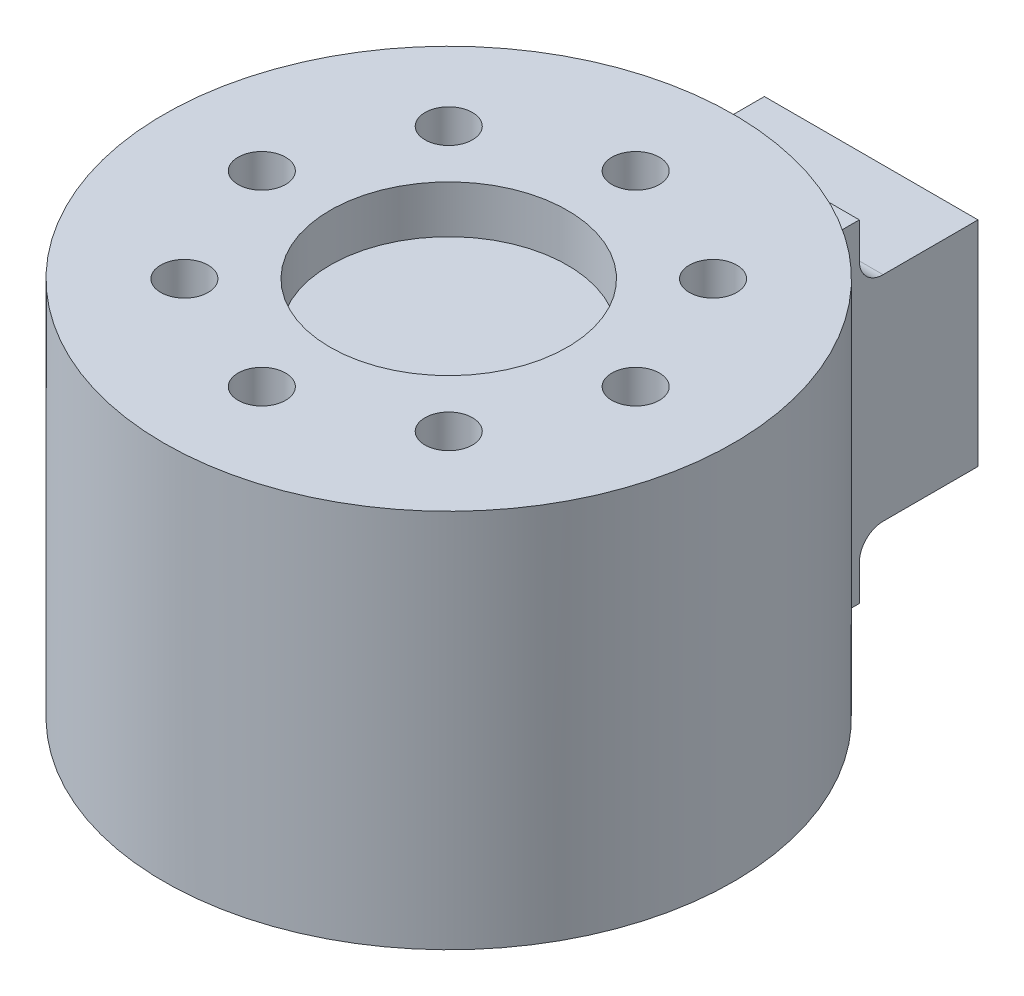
from build123d import *

# Parameters (mm, degrees)
SKETCH1_R           = 24
BOSS_EXTRUDE1_DEPTH = 32
SKETCH2_R           = 10
CUT_EXTRUDE1_DEPTH  = 4
SKETCH3_W           = 18
SKETCH3_H           = 28
BOSS_EXTRUDE2_DEPTH = 35.6
SKETCH4_R           = 1.5
CUT_EXTRUDE2_DEPTH  = 4
SKETCH6_R           = 2
CUT_EXTRUDE4_DEPTH  = 4
CIRPATTERN1_COUNT   = 8
SKETCH5_W           = 10
SKETCH5_H           = 5
CUT_EXTRUDE3_DEPTH  = 59.140863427
FILLET1_R           = 2


with BuildPart() as part:
    # Sketch1 → Boss-Extrude1 (new body)
    with BuildSketch(Plane(origin=(0, 0, 0), x_dir=(1, 0, 0), z_dir=(0, 1, 0))):
        with Locations(Location((0, 0, 0), (0, 0, 270))):
            Circle(SKETCH1_R)
    extrude(amount=BOSS_EXTRUDE1_DEPTH)

    # Sketch2 → Cut-Extrude1 (cut)
    with BuildSketch(Plane(origin=(0, 32, 0), x_dir=(1, 0, 0), z_dir=(0, 1, 0))):
        with Locations(Location((0, 0, 0), (0, 0, 270))):
            Circle(SKETCH2_R)
    extrude(amount=-CUT_EXTRUDE1_DEPTH, mode=Mode.SUBTRACT)

    # Sketch3 → Boss-Extrude2 (add)
    with BuildSketch(Plane.XY):
        with Locations((0, 14)):
            Rectangle(SKETCH3_W, SKETCH3_H)
    extrude(amount=-BOSS_EXTRUDE2_DEPTH)

    # Sketch4 → Cut-Extrude2 (cut)
    with BuildSketch(Plane.XZ):
        with Locations(Location((22, 0, 0), (0, 0, 270))):
            Circle(SKETCH4_R)
    cut_extrude2 = extrude(amount=-CUT_EXTRUDE2_DEPTH, mode=Mode.SUBTRACT)

    # Sketch6 → Cut-Extrude4 (cut)
    with BuildSketch(Plane(origin=(0, 32, 0), x_dir=(1, 0, 0), z_dir=(0, 1, 0))):
        with Locations(Location((0, -15.75, 0), (0, 0, 270))):
            Circle(SKETCH6_R)
    cut_extrude4 = extrude(amount=-CUT_EXTRUDE4_DEPTH, mode=Mode.SUBTRACT)

    # CirPattern1: Cut-Extrude2, Cut-Extrude4 ×8 about axis
    cirpattern1_axis = Axis((0, 0, 0), (0, 1, 0))
    add([cut_extrude2.rotate(cirpattern1_axis, i * 360 / CIRPATTERN1_COUNT) for i in range(1, CIRPATTERN1_COUNT)], mode=Mode.SUBTRACT)
    add([cut_extrude4.rotate(cirpattern1_axis, i * 360 / CIRPATTERN1_COUNT) for i in range(1, CIRPATTERN1_COUNT)], mode=Mode.SUBTRACT)

    # Sketch5 → Cut-Extrude3 (cut, through all)
    with BuildSketch(Plane(origin=(9, 0, 0), x_dir=(0, 0, -1), z_dir=(1, 0, 0))):
        with Locations((30.6, 25.5)):
            Rectangle(SKETCH5_W, SKETCH5_H)
        with Locations((30.6, 2.5)):
            Rectangle(SKETCH5_W, SKETCH5_H)
    extrude(amount=-CUT_EXTRUDE3_DEPTH, mode=Mode.SUBTRACT)

    # Fillet1
    fillet1_edges = [part.edges().sort_by_distance(p)[0] for p in [
        (0, 23, -25.6),
        (0, 5, -25.6),
    ]]
    fillet(fillet1_edges, radius=FILLET1_R)


solid = part.part
